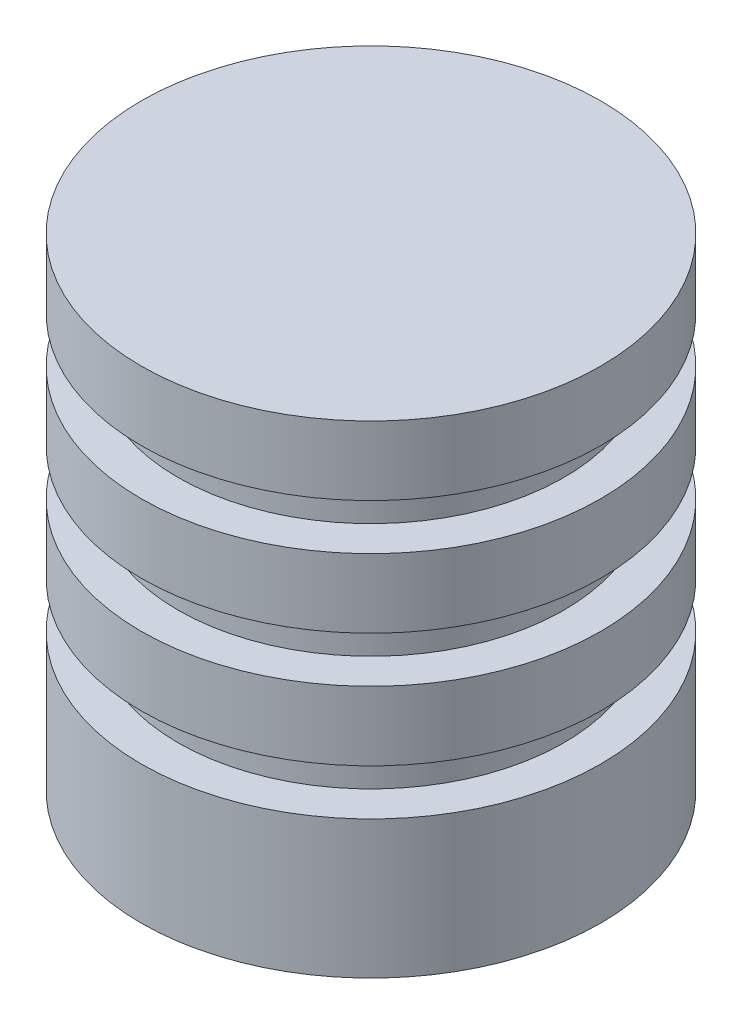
from build123d import *

# Parameters (mm, degrees)
WYTNIJ_WYCI_GNI_CIE1_START = -15
SZKIC2_OUTSIDE_W           = 137.228
SZKIC2_OUTSIDE_H           = 137.228
SZKIC2_OUTSIDE_R           = 42
WYTNIJ_WYCI_GNI_CIE1_DEPTH = 10
SZYK_LINIOWY1_COUNT        = 3
SZYK_LINIOWY1_PITCH        = 25


with BuildPart() as part:
    # Szkic1 → Obr_t1 (revolve)
    with BuildSketch(Plane.XY, mode=Mode.PRIVATE) as obr_t1_sk:
        Polygon((0, 95), (0, 105), (50, 105), (50, 0), (35, 0), (35, 60), (14.792740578, 95), align=None)
    revolve(obr_t1_sk.sketch.rotate(Axis((0, 0, 0), (0, 1, 0)), 90), axis=Axis((0, 0, 0), (0, 1, 0)))

    # Szkic2 outside → Wytnij-wyci_gni_cie1 (cut)
    with BuildSketch(Plane(origin=(0, 105, 0), x_dir=(1, 0, 0), z_dir=(0, 1, 0)).offset(WYTNIJ_WYCI_GNI_CIE1_START)):
        Rectangle(SZKIC2_OUTSIDE_W, SZKIC2_OUTSIDE_H)
        with Locations(Location((0, 0, 0), (0, 0, 270))):
            Circle(SZKIC2_OUTSIDE_R, mode=Mode.SUBTRACT)
    wytnij_wyci_gni_cie1 = extrude(amount=-WYTNIJ_WYCI_GNI_CIE1_DEPTH, mode=Mode.SUBTRACT)

    # Szyk liniowy1: Wytnij-wyci_gni_cie1 ×3
    with Locations(*[(0, -i * SZYK_LINIOWY1_PITCH, 0) for i in range(1, SZYK_LINIOWY1_COUNT)]):
        add(wytnij_wyci_gni_cie1, mode=Mode.SUBTRACT)


solid = part.part
